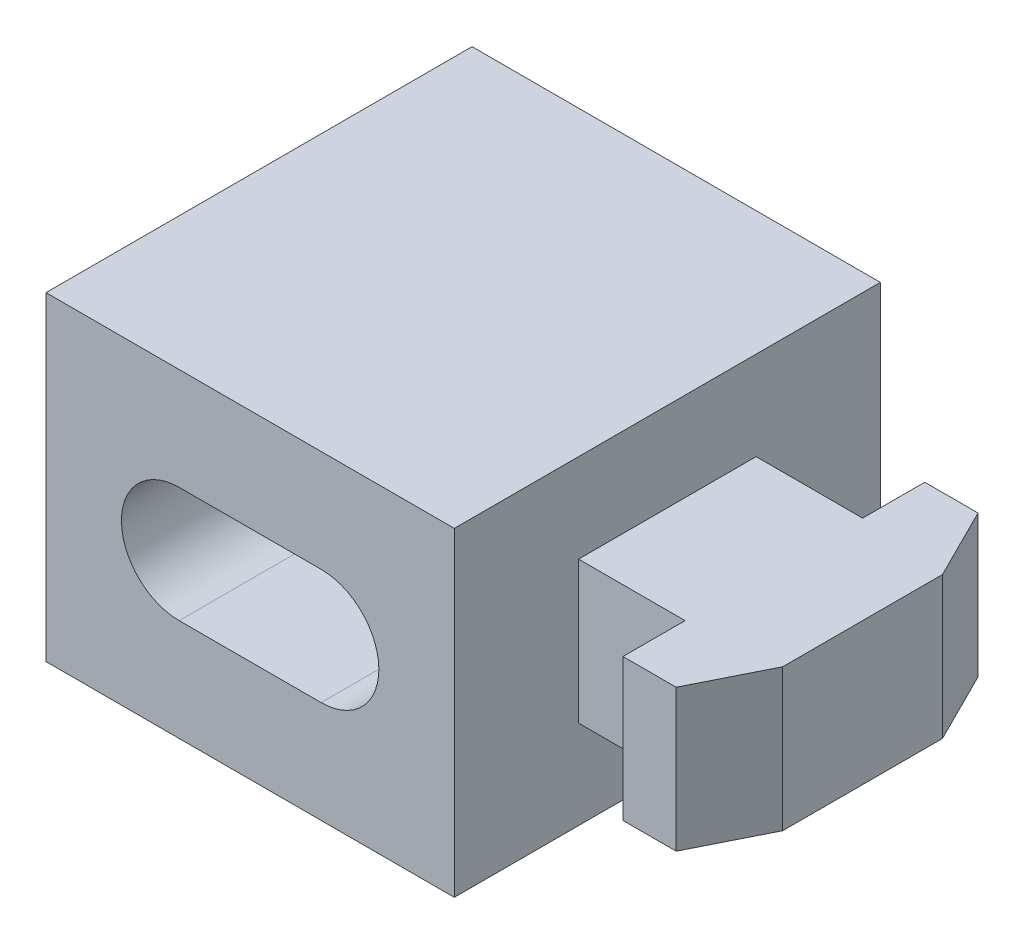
from build123d import *

# Parameters (mm, degrees)
SKETCH_1_W          = 23
SKETCH_1_H          = 18
EXTRUDE_1_DEPTH     = 12
SKETCH_2_W          = 5
SKETCH_2_H          = 10
CUT_EXTRUDE_1_DEPTH = 20
SKETCH_4_W          = 17
SKETCH_4_H          = 8
EXTRUDE_2_DEPTH     = 11
SKETCH_5_W          = 6
SKETCH_5_H          = 3.5
CUT_EXTRUDE_2_DEPTH = 29.622543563
CUT_EXTRUDE_3_DEPTH = 11


with BuildPart() as part:
    # Sketch 1 → Extrude 1 (new, symmetric)
    with BuildSketch(Plane.XY):
        Rectangle(SKETCH_1_W, SKETCH_1_H)
        with BuildLine():
            Line((-4, 3.25), (4, 3.25))
            ThreePointArc((4, 3.25), (7.25, 0), (4, -3.25))
            Line((4, -3.25), (-4, -3.25))
            ThreePointArc((-4, -3.25), (-7.25, 0), (-4, 3.25))
        make_face(mode=Mode.SUBTRACT)
    extrude(amount=EXTRUDE_1_DEPTH, both=True)

    # Sketch 2 → Cut-Extrude 1 (cut)
    with BuildSketch(Plane.ZY.offset(11.5)):
        Rectangle(SKETCH_2_W, SKETCH_2_H)
    extrude(amount=-CUT_EXTRUDE_1_DEPTH, mode=Mode.SUBTRACT)

    # Sketch 4 → Extrude 2 (add)
    with BuildSketch(Plane(origin=(11.5, 0, 0), x_dir=(0, 0, -1), z_dir=(1, 0, 0))):
        Rectangle(SKETCH_4_W, SKETCH_4_H)
    extrude(amount=EXTRUDE_2_DEPTH)

    # Sketch 5 → Cut-Extrude 2 (cut, through all)
    with BuildSketch(Plane(origin=(0, 4, 0), x_dir=(1, 0, 0), z_dir=(0, 1, 0))):
        with Locations((14.5, 6.75)):
            Rectangle(SKETCH_5_W, SKETCH_5_H)
    cut_extrude_2 = extrude(amount=-CUT_EXTRUDE_2_DEPTH, mode=Mode.SUBTRACT)

    # Mirror 1: Cut-Extrude 2 across plane
    add(cut_extrude_2.mirror(Plane.XY), mode=Mode.SUBTRACT)

    # Sketch 6 → Cut-Extrude 3 (cut)
    with BuildSketch(Plane.XZ.offset(4)):
        Polygon((20.5, 8.5), (22.5, 8.5), (22.5, 4.5), align=None)
    cut_extrude_3 = extrude(amount=-CUT_EXTRUDE_3_DEPTH, mode=Mode.SUBTRACT)

    # Mirror 2: Cut-Extrude 3 across plane
    add(cut_extrude_3.mirror(Plane.XY), mode=Mode.SUBTRACT)


solid = part.part
